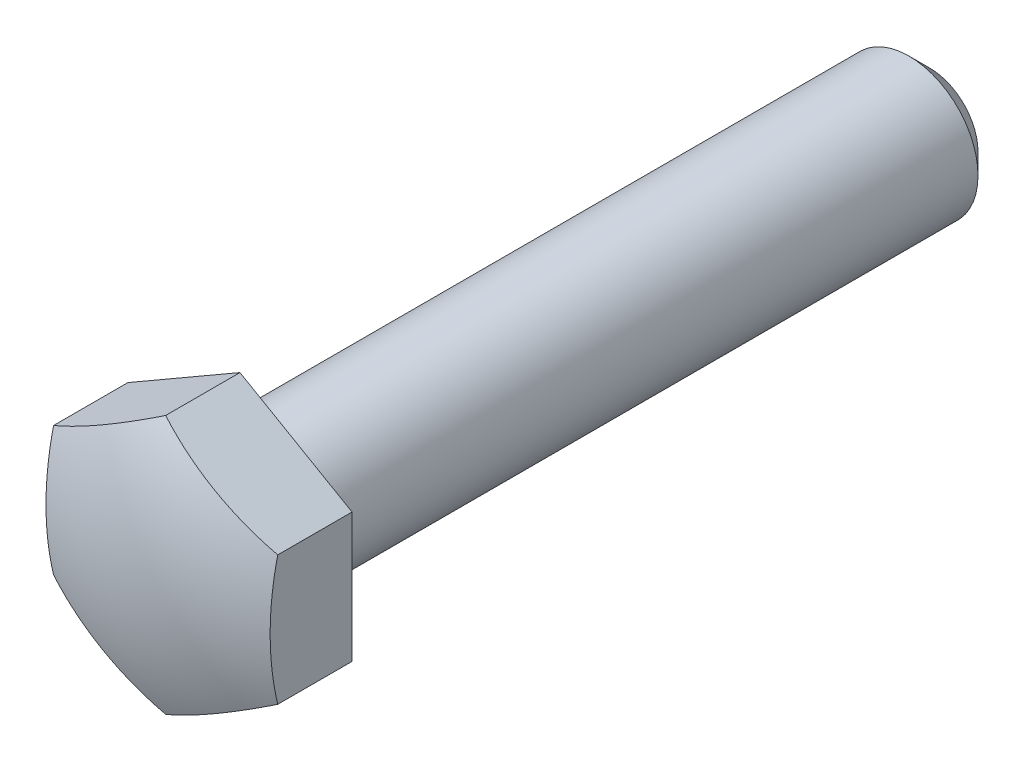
ISO-10303-21;
HEADER;
FILE_DESCRIPTION(('STEP AP214'),'2;1');
FILE_NAME('part.step','',(''),(''),'','','');
FILE_SCHEMA(('AUTOMOTIVE_DESIGN { 1 0 10303 214 1 1 1 1 }'));
ENDSEC;
DATA;
#1=APPLICATION_CONTEXT('core data for automotive mechanical design processes');
#2=APPLICATION_PROTOCOL_DEFINITION('international standard','automotive_design',2000,#1);
#3=PRODUCT_CONTEXT('',#1,'mechanical');
#4=PRODUCT('Part','Part','',(#3));
#5=PRODUCT_RELATED_PRODUCT_CATEGORY('part','',(#4));
#6=PRODUCT_DEFINITION_FORMATION('','',#4);
#7=PRODUCT_DEFINITION_CONTEXT('part definition',#1,'design');
#8=PRODUCT_DEFINITION('design','',#6,#7);
#9=PRODUCT_DEFINITION_SHAPE('','',#8);
#10=(LENGTH_UNIT() NAMED_UNIT(*) SI_UNIT(.MILLI.,.METRE.));
#11=(NAMED_UNIT(*) PLANE_ANGLE_UNIT() SI_UNIT($,.RADIAN.));
#12=(NAMED_UNIT(*) SI_UNIT($,.STERADIAN.) SOLID_ANGLE_UNIT());
#13=UNCERTAINTY_MEASURE_WITH_UNIT(LENGTH_MEASURE(1.E-05),#10,'distance_accuracy_value','');
#14=(GEOMETRIC_REPRESENTATION_CONTEXT(3) GLOBAL_UNCERTAINTY_ASSIGNED_CONTEXT((#13)) GLOBAL_UNIT_ASSIGNED_CONTEXT((#10,
#11,#12)) REPRESENTATION_CONTEXT('',''));
#15=CARTESIAN_POINT('',(0.,0.,0.));
#16=DIRECTION('',(0.,0.,1.));
#17=DIRECTION('',(1.,0.,0.));
#18=AXIS2_PLACEMENT_3D('',#15,#16,#17);
#19=CARTESIAN_POINT('',(4.,0.,0.));
#20=DIRECTION('',(0.,0.,1.));
#21=DIRECTION('',(1.,0.,0.));
#22=AXIS2_PLACEMENT_3D('',#19,#20,#21);
#23=PLANE('',#22);
#24=CARTESIAN_POINT('',(0.,0.,0.));
#25=DIRECTION('',(0.,0.,1.));
#26=DIRECTION('',(1.,0.,0.));
#27=AXIS2_PLACEMENT_3D('',#24,#25,#26);
#28=CIRCLE('',#27,4.);
#29=CARTESIAN_POINT('',(4.,0.,0.));
#30=VERTEX_POINT('',#29);
#31=EDGE_CURVE('E115',#30,#30,#28,.T.);
#32=ORIENTED_EDGE('',*,*,#31,.T.);
#33=EDGE_LOOP('',(#32));
#34=FACE_BOUND('',#33,.T.);
#35=DIRECTION('',(-0.86602540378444,-0.5,0.));
#36=VECTOR('',#35,1.);
#37=CARTESIAN_POINT('',(6.5,-3.75277674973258,0.));
#38=LINE('',#37,#36);
#39=CARTESIAN_POINT('',(6.5,-3.75277674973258,0.));
#40=VERTEX_POINT('',#39);
#41=CARTESIAN_POINT('',(0.,-7.50555349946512,0.));
#42=VERTEX_POINT('',#41);
#43=EDGE_CURVE('E89',#40,#42,#38,.T.);
#44=ORIENTED_EDGE('',*,*,#43,.T.);
#45=DIRECTION('',(0.86602540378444,-0.5,0.));
#46=VECTOR('',#45,1.);
#47=CARTESIAN_POINT('',(-6.5,-3.75277674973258,0.));
#48=LINE('',#47,#46);
#49=CARTESIAN_POINT('',(-6.5,-3.75277674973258,0.));
#50=VERTEX_POINT('',#49);
#51=EDGE_CURVE('E87',#50,#42,#48,.T.);
#52=ORIENTED_EDGE('',*,*,#51,.F.);
#53=DIRECTION('',(0.,-1.,0.));
#54=VECTOR('',#53,1.);
#55=CARTESIAN_POINT('',(-6.5,3.75277674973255,0.));
#56=LINE('',#55,#54);
#57=CARTESIAN_POINT('',(-6.5,3.75277674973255,0.));
#58=VERTEX_POINT('',#57);
#59=EDGE_CURVE('E37',#58,#50,#56,.T.);
#60=ORIENTED_EDGE('',*,*,#59,.F.);
#61=DIRECTION('',(0.866025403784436,0.5,0.));
#62=VECTOR('',#61,1.);
#63=CARTESIAN_POINT('',(-6.5,3.75277674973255,0.));
#64=LINE('',#63,#62);
#65=CARTESIAN_POINT('',(0.,7.50555349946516,0.));
#66=VERTEX_POINT('',#65);
#67=EDGE_CURVE('E77',#58,#66,#64,.T.);
#68=ORIENTED_EDGE('',*,*,#67,.T.);
#69=DIRECTION('',(-0.866025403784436,0.5,0.));
#70=VECTOR('',#69,1.);
#71=CARTESIAN_POINT('',(6.5,3.75277674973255,0.));
#72=LINE('',#71,#70);
#73=CARTESIAN_POINT('',(6.5,3.75277674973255,0.));
#74=VERTEX_POINT('',#73);
#75=EDGE_CURVE('E83',#74,#66,#72,.T.);
#76=ORIENTED_EDGE('',*,*,#75,.F.);
#77=DIRECTION('',(0.,-1.,0.));
#78=VECTOR('',#77,1.);
#79=CARTESIAN_POINT('',(6.5,3.75277674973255,0.));
#80=LINE('',#79,#78);
#81=EDGE_CURVE('E95',#74,#40,#80,.T.);
#82=ORIENTED_EDGE('',*,*,#81,.T.);
#83=EDGE_LOOP('',(#44,#52,#60,#68,#76,#82));
#84=FACE_BOUND('',#83,.T.);
#85=ADVANCED_FACE('F14',(#34,#84),#23,.F.);
#86=CARTESIAN_POINT('',(0.,0.,20.));
#87=DIRECTION('',(0.,0.,1.));
#88=DIRECTION('',(1.,0.,0.));
#89=AXIS2_PLACEMENT_3D('',#86,#87,#88);
#90=CYLINDRICAL_SURFACE('',#89,4.);
#91=CARTESIAN_POINT('',(0.,0.,-38.8));
#92=DIRECTION('',(0.,0.,1.));
#93=DIRECTION('',(1.,0.,0.));
#94=AXIS2_PLACEMENT_3D('',#91,#92,#93);
#95=CIRCLE('',#94,4.);
#96=CARTESIAN_POINT('',(4.,0.,-38.8));
#97=VERTEX_POINT('',#96);
#98=EDGE_CURVE('E22',#97,#97,#95,.T.);
#99=ORIENTED_EDGE('',*,*,#98,.T.);
#100=EDGE_LOOP('',(#99));
#101=FACE_BOUND('',#100,.T.);
#102=ORIENTED_EDGE('',*,*,#31,.F.);
#103=EDGE_LOOP('',(#102));
#104=FACE_BOUND('',#103,.T.);
#105=ADVANCED_FACE('F120',(#101,#104),#90,.T.);
#106=CARTESIAN_POINT('',(0.,0.,-40.));
#107=DIRECTION('',(0.,0.,1.));
#108=DIRECTION('',(1.,0.,0.));
#109=AXIS2_PLACEMENT_3D('',#106,#107,#108);
#110=PLANE('',#109);
#111=CARTESIAN_POINT('',(0.,0.,-40.));
#112=DIRECTION('',(0.,0.,1.));
#113=DIRECTION('',(1.,0.,0.));
#114=AXIS2_PLACEMENT_3D('',#111,#112,#113);
#115=CIRCLE('',#114,2.8);
#116=CARTESIAN_POINT('',(2.8,0.,-40.));
#117=VERTEX_POINT('',#116);
#118=EDGE_CURVE('E9',#117,#117,#115,.F.);
#119=ORIENTED_EDGE('',*,*,#118,.T.);
#120=EDGE_LOOP('',(#119));
#121=FACE_BOUND('',#120,.T.);
#122=ADVANCED_FACE('F139',(#121),#110,.F.);
#123=CARTESIAN_POINT('',(6.5,-3.75277674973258,6.));
#124=DIRECTION('',(0.5,-0.86602540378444,0.));
#125=DIRECTION('',(0.86602540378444,0.5,0.));
#126=AXIS2_PLACEMENT_3D('',#123,#124,#125);
#127=PLANE('',#126);
#128=DIRECTION('',(0.,0.,-1.));
#129=VECTOR('',#128,1.);
#130=CARTESIAN_POINT('',(0.,-7.50555349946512,6.));
#131=LINE('',#130,#129);
#132=CARTESIAN_POINT('',(0.,-7.50555349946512,4.30875284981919));
#133=VERTEX_POINT('',#132);
#134=EDGE_CURVE('E29',#133,#42,#131,.T.);
#135=ORIENTED_EDGE('',*,*,#134,.T.);
#136=ORIENTED_EDGE('',*,*,#43,.F.);
#137=DIRECTION('',(0.,0.,-1.));
#138=VECTOR('',#137,1.);
#139=CARTESIAN_POINT('',(6.5,-3.75277674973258,6.));
#140=LINE('',#139,#138);
#141=CARTESIAN_POINT('',(6.5,-3.75277674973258,4.30875284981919));
#142=VERTEX_POINT('',#141);
#143=EDGE_CURVE('E100',#142,#40,#140,.T.);
#144=ORIENTED_EDGE('',*,*,#143,.F.);
#145=CARTESIAN_POINT('',(3.25,-5.62916512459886,-11.5));
#146=DIRECTION('',(0.5,-0.86602540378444,0.));
#147=DIRECTION('',(0.86602540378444,0.5,0.));
#148=AXIS2_PLACEMENT_3D('',#145,#146,#147);
#149=CIRCLE('',#148,16.248076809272);
#150=EDGE_CURVE('E112',#133,#142,#149,.F.);
#151=ORIENTED_EDGE('',*,*,#150,.F.);
#152=EDGE_LOOP('',(#135,#136,#144,#151));
#153=FACE_BOUND('',#152,.T.);
#154=ADVANCED_FACE('F144',(#153),#127,.T.);
#155=CARTESIAN_POINT('',(6.5,3.75277674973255,6.));
#156=DIRECTION('',(1.,0.,0.));
#157=DIRECTION('',(0.,1.,0.));
#158=AXIS2_PLACEMENT_3D('',#155,#156,#157);
#159=PLANE('',#158);
#160=ORIENTED_EDGE('',*,*,#143,.T.);
#161=ORIENTED_EDGE('',*,*,#81,.F.);
#162=DIRECTION('',(0.,0.,-1.));
#163=VECTOR('',#162,1.);
#164=CARTESIAN_POINT('',(6.5,3.75277674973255,6.));
#165=LINE('',#164,#163);
#166=CARTESIAN_POINT('',(6.5,3.75277674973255,4.30875284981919));
#167=VERTEX_POINT('',#166);
#168=EDGE_CURVE('E98',#167,#74,#165,.T.);
#169=ORIENTED_EDGE('',*,*,#168,.F.);
#170=CARTESIAN_POINT('',(6.5,0.,-11.5));
#171=DIRECTION('',(1.,0.,0.));
#172=DIRECTION('',(0.,1.,0.));
#173=AXIS2_PLACEMENT_3D('',#170,#171,#172);
#174=CIRCLE('',#173,16.248076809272);
#175=EDGE_CURVE('E109',#142,#167,#174,.F.);
#176=ORIENTED_EDGE('',*,*,#175,.F.);
#177=EDGE_LOOP('',(#160,#161,#169,#176));
#178=FACE_BOUND('',#177,.T.);
#179=ADVANCED_FACE('F146',(#178),#159,.T.);
#180=CARTESIAN_POINT('',(6.5,3.75277674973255,6.));
#181=DIRECTION('',(-0.5,-0.866025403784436,0.));
#182=DIRECTION('',(0.866025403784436,-0.5,0.));
#183=AXIS2_PLACEMENT_3D('',#180,#181,#182);
#184=PLANE('',#183);
#185=CARTESIAN_POINT('',(3.25,5.62916512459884,-11.5));
#186=DIRECTION('',(-0.5,-0.866025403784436,0.));
#187=DIRECTION('',(0.866025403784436,-0.5,0.));
#188=AXIS2_PLACEMENT_3D('',#185,#186,#187);
#189=CIRCLE('',#188,16.2480768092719);
#190=CARTESIAN_POINT('',(0.,7.50555349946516,4.30875284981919));
#191=VERTEX_POINT('',#190);
#192=EDGE_CURVE('E107',#191,#167,#189,.F.);
#193=ORIENTED_EDGE('',*,*,#192,.T.);
#194=ORIENTED_EDGE('',*,*,#168,.T.);
#195=ORIENTED_EDGE('',*,*,#75,.T.);
#196=DIRECTION('',(0.,0.,-1.));
#197=VECTOR('',#196,1.);
#198=CARTESIAN_POINT('',(0.,7.50555349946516,6.));
#199=LINE('',#198,#197);
#200=EDGE_CURVE('E73',#191,#66,#199,.T.);
#201=ORIENTED_EDGE('',*,*,#200,.F.);
#202=EDGE_LOOP('',(#193,#194,#195,#201));
#203=FACE_BOUND('',#202,.T.);
#204=ADVANCED_FACE('F149',(#203),#184,.F.);
#205=CARTESIAN_POINT('',(-6.5,3.75277674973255,6.));
#206=DIRECTION('',(-0.5,0.866025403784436,0.));
#207=DIRECTION('',(-0.866025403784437,-0.5,0.));
#208=AXIS2_PLACEMENT_3D('',#205,#206,#207);
#209=PLANE('',#208);
#210=ORIENTED_EDGE('',*,*,#200,.T.);
#211=ORIENTED_EDGE('',*,*,#67,.F.);
#212=DIRECTION('',(0.,0.,-1.));
#213=VECTOR('',#212,1.);
#214=CARTESIAN_POINT('',(-6.5,3.75277674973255,6.));
#215=LINE('',#214,#213);
#216=CARTESIAN_POINT('',(-6.5,3.75277674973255,4.30875284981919));
#217=VERTEX_POINT('',#216);
#218=EDGE_CURVE('E66',#217,#58,#215,.T.);
#219=ORIENTED_EDGE('',*,*,#218,.F.);
#220=CARTESIAN_POINT('',(-3.25,5.62916512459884,-11.5));
#221=DIRECTION('',(-0.5,0.866025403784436,0.));
#222=DIRECTION('',(-0.866025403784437,-0.5,0.));
#223=AXIS2_PLACEMENT_3D('',#220,#221,#222);
#224=CIRCLE('',#223,16.2480768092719);
#225=EDGE_CURVE('E105',#191,#217,#224,.F.);
#226=ORIENTED_EDGE('',*,*,#225,.F.);
#227=EDGE_LOOP('',(#210,#211,#219,#226));
#228=FACE_BOUND('',#227,.T.);
#229=ADVANCED_FACE('F78',(#228),#209,.T.);
#230=CARTESIAN_POINT('',(-6.5,3.75277674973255,6.));
#231=DIRECTION('',(1.,0.,0.));
#232=DIRECTION('',(0.,0.,-1.));
#233=AXIS2_PLACEMENT_3D('',#230,#231,#232);
#234=PLANE('',#233);
#235=CARTESIAN_POINT('',(-6.5,0.,-11.5));
#236=DIRECTION('',(1.,0.,0.));
#237=DIRECTION('',(0.,0.,-1.));
#238=AXIS2_PLACEMENT_3D('',#235,#236,#237);
#239=CIRCLE('',#238,16.2480768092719);
#240=CARTESIAN_POINT('',(-6.5,-3.75277674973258,4.30875284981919));
#241=VERTEX_POINT('',#240);
#242=EDGE_CURVE('E70',#241,#217,#239,.F.);
#243=ORIENTED_EDGE('',*,*,#242,.T.);
#244=ORIENTED_EDGE('',*,*,#218,.T.);
#245=ORIENTED_EDGE('',*,*,#59,.T.);
#246=DIRECTION('',(0.,0.,-1.));
#247=VECTOR('',#246,1.);
#248=CARTESIAN_POINT('',(-6.5,-3.75277674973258,6.));
#249=LINE('',#248,#247);
#250=EDGE_CURVE('E74',#241,#50,#249,.T.);
#251=ORIENTED_EDGE('',*,*,#250,.F.);
#252=EDGE_LOOP('',(#243,#244,#245,#251));
#253=FACE_BOUND('',#252,.T.);
#254=ADVANCED_FACE('F68',(#253),#234,.F.);
#255=CARTESIAN_POINT('',(-6.5,-3.75277674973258,6.));
#256=DIRECTION('',(0.5,0.86602540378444,0.));
#257=DIRECTION('',(-0.86602540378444,0.5,0.));
#258=AXIS2_PLACEMENT_3D('',#255,#256,#257);
#259=PLANE('',#258);
#260=CARTESIAN_POINT('',(-3.25,-5.62916512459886,-11.5));
#261=DIRECTION('',(0.5,0.86602540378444,0.));
#262=DIRECTION('',(-0.86602540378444,0.5,0.));
#263=AXIS2_PLACEMENT_3D('',#260,#261,#262);
#264=CIRCLE('',#263,16.248076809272);
#265=EDGE_CURVE('E102',#133,#241,#264,.F.);
#266=ORIENTED_EDGE('',*,*,#265,.T.);
#267=ORIENTED_EDGE('',*,*,#250,.T.);
#268=ORIENTED_EDGE('',*,*,#51,.T.);
#269=ORIENTED_EDGE('',*,*,#134,.F.);
#270=EDGE_LOOP('',(#266,#267,#268,#269));
#271=FACE_BOUND('',#270,.T.);
#272=ADVANCED_FACE('F130',(#271),#259,.F.);
#273=CARTESIAN_POINT('',(0.,0.,-11.5));
#274=DIRECTION('',(0.,0.,1.));
#275=DIRECTION('',(1.,0.,0.));
#276=AXIS2_PLACEMENT_3D('',#273,#274,#275);
#277=SPHERICAL_SURFACE('',#276,17.5);
#278=ORIENTED_EDGE('',*,*,#265,.F.);
#279=ORIENTED_EDGE('',*,*,#150,.T.);
#280=ORIENTED_EDGE('',*,*,#175,.T.);
#281=ORIENTED_EDGE('',*,*,#192,.F.);
#282=ORIENTED_EDGE('',*,*,#225,.T.);
#283=ORIENTED_EDGE('',*,*,#242,.F.);
#284=EDGE_LOOP('',(#278,#279,#280,#281,#282,#283));
#285=FACE_BOUND('',#284,.T.);
#286=ADVANCED_FACE('F124',(#285),#277,.T.);
#287=CARTESIAN_POINT('',(0.,0.,-38.8));
#288=DIRECTION('',(0.,0.,1.));
#289=DIRECTION('',(1.,0.,0.));
#290=AXIS2_PLACEMENT_3D('',#287,#288,#289);
#291=CONICAL_SURFACE('',#290,4.,0.785398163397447);
#292=ORIENTED_EDGE('',*,*,#118,.F.);
#293=EDGE_LOOP('',(#292));
#294=FACE_BOUND('',#293,.T.);
#295=ORIENTED_EDGE('',*,*,#98,.F.);
#296=EDGE_LOOP('',(#295));
#297=FACE_BOUND('',#296,.T.);
#298=ADVANCED_FACE('F16',(#294,#297),#291,.T.);
#299=CLOSED_SHELL('',(#85,#105,#122,#154,#179,#204,#229,#254,#272,#286,#298));
#300=MANIFOLD_SOLID_BREP('B1',#299);
#301=ADVANCED_BREP_SHAPE_REPRESENTATION('',(#18,#300),#14);
#302=SHAPE_DEFINITION_REPRESENTATION(#9,#301);
ENDSEC;
END-ISO-10303-21;
